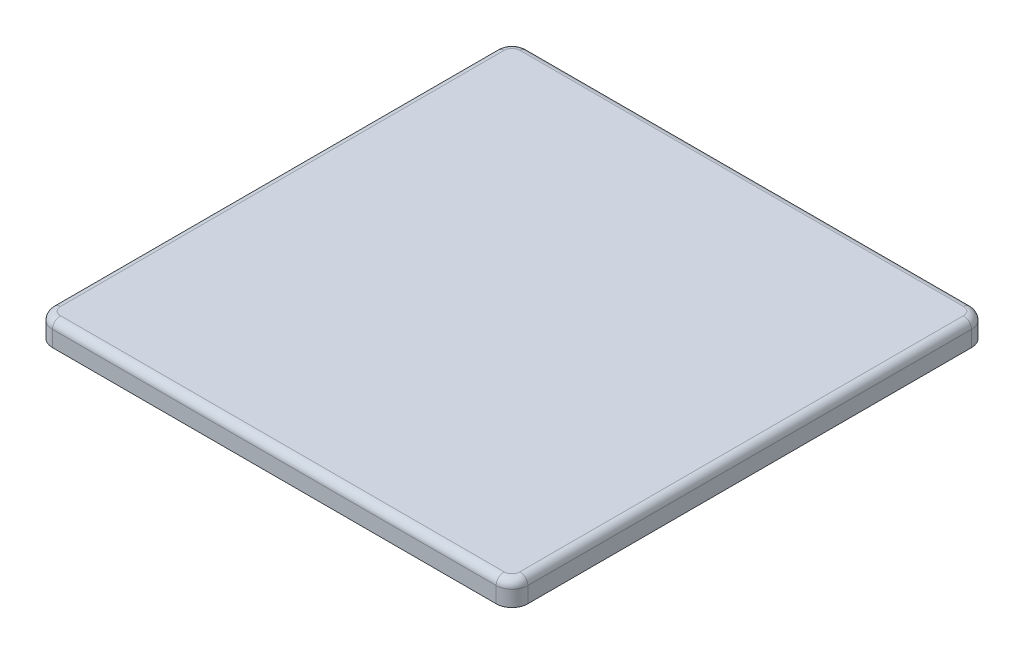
from build123d import *

# Parameters (mm, degrees)
EXTRUDE_1_DEPTH           = 1.5
FILLET_1_R                = 1
CUT_EXTRUDE_2_DEPTH       = 1
SKETCH_4_W                = 3.3
SKETCH_4_H                = 4.9
EXTRUDE_4_DEPTH           = 8
EXTRUDE_4_DRAFT           = 0.6
EXTRUDE_4_PROFILE_2_DEPTH = 8
EXTRUDE_4_PROFILE_2_DRAFT = 0.6
EXTRUDE_4_PROFILE_3_DEPTH = 8
EXTRUDE_4_PROFILE_3_DRAFT = 0.6
EXTRUDE_4_PROFILE_4_DEPTH = 8
EXTRUDE_4_PROFILE_4_DRAFT = 0.6
FILLET_2_R                = 0.8


with BuildPart() as part:
    # Sketch 1 → Extrude 1 (new, symmetric)
    with BuildSketch(Plane(origin=(0, 0, 0), x_dir=(0, 0, -1), z_dir=(0, 1, 0))):
        with BuildLine():
            Line((-28, 30), (28, 30))
            ThreePointArc((28, 30), (29.414213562, 29.414213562), (30, 28))
            Line((30, 28), (30, -28))
            ThreePointArc((30, -28), (29.414213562, -29.414213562), (28, -30))
            Line((28, -30), (-28, -30))
            ThreePointArc((-28, -30), (-29.414213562, -29.414213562), (-30, -28))
            Line((-30, -28), (-30, 28))
            ThreePointArc((-30, 28), (-29.414213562, 29.414213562), (-28, 30))
        make_face()
    extrude(amount=EXTRUDE_1_DEPTH, both=True)

    # Fillet 1
    fillet_1_edges = [part.edges().sort_by_distance(p)[0] for p in [
        (-29.414213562, 1.5, 29.414213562),
        (0, 1.5, 30),
        (29.414213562, 1.5, 29.414213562),
        (30, 1.5, 0),
        (29.414213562, 1.5, -29.414213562),
        (0, 1.5, -30),
        (-29.414213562, 1.5, -29.414213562),
        (-30, 1.5, 0),
    ]]
    fillet(fillet_1_edges, radius=FILLET_1_R)

    # Sketch 2 → Cut-Extrude 2 (cut)
    with BuildSketch(Plane.XZ.offset(1.5)):
        with BuildLine():
            Line((-28, 28.2), (28, 28.2))
            ThreePointArc((28, 28.2), (28.141421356, 28.141421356), (28.2, 28))
            Line((28.2, 28), (28.2, -28))
            ThreePointArc((28.2, -28), (28.141421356, -28.141421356), (28, -28.2))
            Line((28, -28.2), (-28, -28.2))
            ThreePointArc((-28, -28.2), (-28.141421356, -28.141421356), (-28.2, -28))
            Line((-28.2, -28), (-28.2, 28))
            ThreePointArc((-28.2, 28), (-28.141421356, 28.141421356), (-28, 28.2))
        make_face()
    extrude(amount=-CUT_EXTRUDE_2_DEPTH, mode=Mode.SUBTRACT)


with BuildPart() as extrude_4_tool:
    # Sketch 4 → Extrude 4 (with draft: the straight prism first)
    with BuildSketch(Plane.XZ.offset(0.5)):
        with Locations((-15, 15)):
            Rectangle(SKETCH_4_W, SKETCH_4_H)
    extrude(amount=EXTRUDE_4_DEPTH)
    # Extrude 4: the draft: its side faces are tilted about the plane it starts from
    extrude_4_sides = [extrude_4_tool.faces().sort_by_distance(p)[0] for p in [
        (-16.65, -4.5, 15),
        (-15, -4.5, 12.55),
        (-13.35, -4.5, 15),
        (-15, -4.5, 17.45),
    ]]
    draft(extrude_4_sides, Plane.XZ.offset(0.5), EXTRUDE_4_DRAFT)


with BuildPart() as part_1:
    add(part.part)

    # Extrude 4: add extrude_4_tool
    add(extrude_4_tool.part)


with BuildPart() as extrude_4_profile_2_tool:
    # Sketch 4 → Extrude 4 profile 2 (with draft: the straight prism first)
    with BuildSketch(Plane.XZ.offset(0.5)):
        with Locations((15, 15)):
            Rectangle(SKETCH_4_W, SKETCH_4_H)
    extrude(amount=EXTRUDE_4_PROFILE_2_DEPTH)
    # Extrude 4 profile 2: the draft: its side faces are tilted about the plane it starts from
    extrude_4_profile_2_sides = [extrude_4_profile_2_tool.faces().sort_by_distance(p)[0] for p in [
        (15, -4.5, 12.55),
        (16.65, -4.5, 15),
        (15, -4.5, 17.45),
        (13.35, -4.5, 15),
    ]]
    draft(extrude_4_profile_2_sides, Plane.XZ.offset(0.5), EXTRUDE_4_PROFILE_2_DRAFT)


with BuildPart() as part_2:
    add(part_1.part)

    # Extrude 4 profile 2: add extrude_4_profile_2_tool
    add(extrude_4_profile_2_tool.part)


with BuildPart() as extrude_4_profile_3_tool:
    # Sketch 4 → Extrude 4 profile 3 (with draft: the straight prism first)
    with BuildSketch(Plane.XZ.offset(0.5)):
        with Locations((-15, -15)):
            Rectangle(SKETCH_4_W, SKETCH_4_H)
    extrude(amount=EXTRUDE_4_PROFILE_3_DEPTH)
    # Extrude 4 profile 3: the draft: its side faces are tilted about the plane it starts from
    extrude_4_profile_3_sides = [extrude_4_profile_3_tool.faces().sort_by_distance(p)[0] for p in [
        (-16.65, -4.5, -15),
        (-15, -4.5, -17.45),
        (-13.35, -4.5, -15),
        (-15, -4.5, -12.55),
    ]]
    draft(extrude_4_profile_3_sides, Plane.XZ.offset(0.5), EXTRUDE_4_PROFILE_3_DRAFT)


with BuildPart() as part_3:
    add(part_2.part)

    # Extrude 4 profile 3: add extrude_4_profile_3_tool
    add(extrude_4_profile_3_tool.part)


with BuildPart() as extrude_4_profile_4_tool:
    # Sketch 4 → Extrude 4 profile 4 (with draft: the straight prism first)
    with BuildSketch(Plane.XZ.offset(0.5)):
        with Locations((15, -15)):
            Rectangle(SKETCH_4_W, SKETCH_4_H)
    extrude(amount=EXTRUDE_4_PROFILE_4_DEPTH)
    # Extrude 4 profile 4: the draft: its side faces are tilted about the plane it starts from
    extrude_4_profile_4_sides = [extrude_4_profile_4_tool.faces().sort_by_distance(p)[0] for p in [
        (13.35, -4.5, -15),
        (15, -4.5, -17.45),
        (16.65, -4.5, -15),
        (15, -4.5, -12.55),
    ]]
    draft(extrude_4_profile_4_sides, Plane.XZ.offset(0.5), EXTRUDE_4_PROFILE_4_DRAFT)


with BuildPart() as part_4:
    add(part_3.part)

    # Extrude 4 profile 4: add extrude_4_profile_4_tool
    add(extrude_4_profile_4_tool.part)

    # Fillet 2
    fillet_2_edges = [part_4.edges().sort_by_distance(p)[0] for p in [
        (13.433778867, -8.5, -15),
        (15, -8.5, -17.366221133),
        (16.566221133, -8.5, -15),
        (15, -8.5, -12.633778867),
        (-16.566221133, -8.5, 15),
        (-15, -8.5, 12.633778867),
        (-13.433778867, -8.5, 15),
        (-15, -8.5, 17.366221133),
        (13.433778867, -8.5, 15),
        (15, -8.5, 12.633778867),
        (16.566221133, -8.5, 15),
        (15, -8.5, 17.366221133),
        (-16.566221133, -8.5, -15),
        (-15, -8.5, -17.366221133),
        (-13.433778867, -8.5, -15),
        (-15, -8.5, -12.633778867),
    ]]
    fillet(fillet_2_edges, radius=FILLET_2_R)


solid = part_4.part
